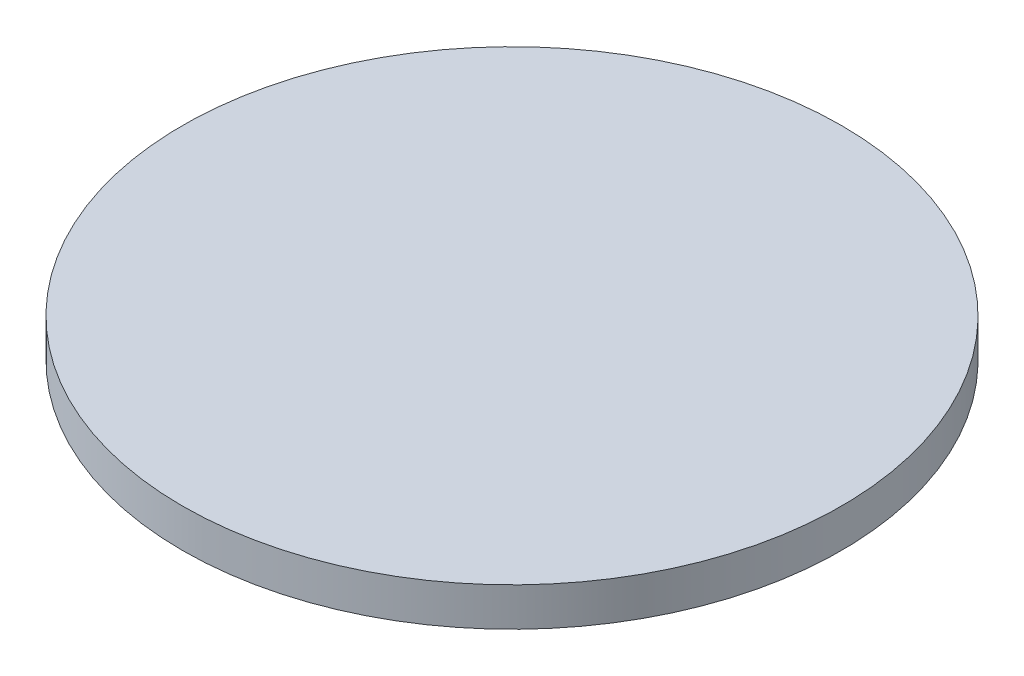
ISO-10303-21;
HEADER;
FILE_DESCRIPTION(('STEP AP214'),'2;1');
FILE_NAME('part.step','',(''),(''),'','','');
FILE_SCHEMA(('AUTOMOTIVE_DESIGN { 1 0 10303 214 1 1 1 1 }'));
ENDSEC;
DATA;
#1=APPLICATION_CONTEXT('core data for automotive mechanical design processes');
#2=APPLICATION_PROTOCOL_DEFINITION('international standard','automotive_design',2000,#1);
#3=PRODUCT_CONTEXT('',#1,'mechanical');
#4=PRODUCT('Part','Part','',(#3));
#5=PRODUCT_RELATED_PRODUCT_CATEGORY('part','',(#4));
#6=PRODUCT_DEFINITION_FORMATION('','',#4);
#7=PRODUCT_DEFINITION_CONTEXT('part definition',#1,'design');
#8=PRODUCT_DEFINITION('design','',#6,#7);
#9=PRODUCT_DEFINITION_SHAPE('','',#8);
#10=(LENGTH_UNIT() NAMED_UNIT(*) SI_UNIT(.MILLI.,.METRE.));
#11=(NAMED_UNIT(*) PLANE_ANGLE_UNIT() SI_UNIT($,.RADIAN.));
#12=(NAMED_UNIT(*) SI_UNIT($,.STERADIAN.) SOLID_ANGLE_UNIT());
#13=UNCERTAINTY_MEASURE_WITH_UNIT(LENGTH_MEASURE(1.E-05),#10,'distance_accuracy_value','');
#14=(GEOMETRIC_REPRESENTATION_CONTEXT(3) GLOBAL_UNCERTAINTY_ASSIGNED_CONTEXT((#13)) GLOBAL_UNIT_ASSIGNED_CONTEXT((#10,
#11,#12)) REPRESENTATION_CONTEXT('',''));
#15=CARTESIAN_POINT('',(0.,0.,0.));
#16=DIRECTION('',(0.,0.,1.));
#17=DIRECTION('',(1.,0.,0.));
#18=AXIS2_PLACEMENT_3D('',#15,#16,#17);
#19=CARTESIAN_POINT('',(0.,3.175,0.));
#20=DIRECTION('',(0.,-1.,0.));
#21=DIRECTION('',(0.,0.,-1.));
#22=AXIS2_PLACEMENT_3D('',#19,#20,#21);
#23=CYLINDRICAL_SURFACE('',#22,27.178);
#24=CARTESIAN_POINT('',(0.,3.175,0.));
#25=DIRECTION('',(0.,1.,0.));
#26=DIRECTION('',(0.,0.,1.));
#27=AXIS2_PLACEMENT_3D('',#24,#25,#26);
#28=CIRCLE('',#27,27.178);
#29=CARTESIAN_POINT('',(0.,3.175,27.178));
#30=VERTEX_POINT('',#29);
#31=EDGE_CURVE('E10',#30,#30,#28,.T.);
#32=ORIENTED_EDGE('',*,*,#31,.F.);
#33=EDGE_LOOP('',(#32));
#34=FACE_BOUND('',#33,.T.);
#35=CARTESIAN_POINT('',(0.,0.,0.));
#36=DIRECTION('',(0.,1.,0.));
#37=DIRECTION('',(0.,0.,1.));
#38=AXIS2_PLACEMENT_3D('',#35,#36,#37);
#39=CIRCLE('',#38,27.178);
#40=CARTESIAN_POINT('',(0.,0.,27.178));
#41=VERTEX_POINT('',#40);
#42=EDGE_CURVE('E34',#41,#41,#39,.T.);
#43=ORIENTED_EDGE('',*,*,#42,.T.);
#44=EDGE_LOOP('',(#43));
#45=FACE_BOUND('',#44,.T.);
#46=ADVANCED_FACE('F31',(#34,#45),#23,.T.);
#47=CARTESIAN_POINT('',(0.,3.175,0.));
#48=DIRECTION('',(0.,1.,0.));
#49=DIRECTION('',(0.,0.,1.));
#50=AXIS2_PLACEMENT_3D('',#47,#48,#49);
#51=PLANE('',#50);
#52=ORIENTED_EDGE('',*,*,#31,.T.);
#53=EDGE_LOOP('',(#52));
#54=FACE_BOUND('',#53,.T.);
#55=ADVANCED_FACE('F46',(#54),#51,.T.);
#56=CARTESIAN_POINT('',(0.,0.,0.));
#57=DIRECTION('',(0.,1.,0.));
#58=DIRECTION('',(0.,0.,1.));
#59=AXIS2_PLACEMENT_3D('',#56,#57,#58);
#60=PLANE('',#59);
#61=ORIENTED_EDGE('',*,*,#42,.F.);
#62=EDGE_LOOP('',(#61));
#63=FACE_BOUND('',#62,.T.);
#64=ADVANCED_FACE('F44',(#63),#60,.F.);
#65=CLOSED_SHELL('',(#46,#55,#64));
#66=MANIFOLD_SOLID_BREP('B2',#65);
#67=ADVANCED_BREP_SHAPE_REPRESENTATION('',(#18,#66),#14);
#68=SHAPE_DEFINITION_REPRESENTATION(#9,#67);
ENDSEC;
END-ISO-10303-21;
